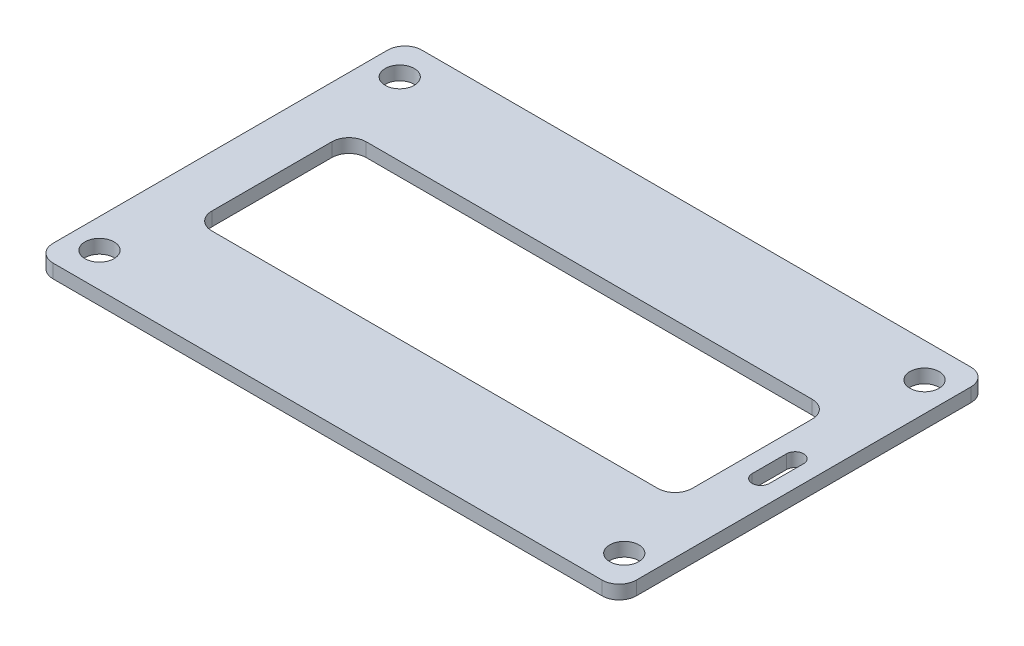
ISO-10303-21;
HEADER;
FILE_DESCRIPTION(('STEP AP214'),'2;1');
FILE_NAME('part.step','',(''),(''),'','','');
FILE_SCHEMA(('AUTOMOTIVE_DESIGN { 1 0 10303 214 1 1 1 1 }'));
ENDSEC;
DATA;
#1=APPLICATION_CONTEXT('core data for automotive mechanical design processes');
#2=APPLICATION_PROTOCOL_DEFINITION('international standard','automotive_design',2000,#1);
#3=PRODUCT_CONTEXT('',#1,'mechanical');
#4=PRODUCT('Part','Part','',(#3));
#5=PRODUCT_RELATED_PRODUCT_CATEGORY('part','',(#4));
#6=PRODUCT_DEFINITION_FORMATION('','',#4);
#7=PRODUCT_DEFINITION_CONTEXT('part definition',#1,'design');
#8=PRODUCT_DEFINITION('design','',#6,#7);
#9=PRODUCT_DEFINITION_SHAPE('','',#8);
#10=(LENGTH_UNIT() NAMED_UNIT(*) SI_UNIT(.MILLI.,.METRE.));
#11=(NAMED_UNIT(*) PLANE_ANGLE_UNIT() SI_UNIT($,.RADIAN.));
#12=(NAMED_UNIT(*) SI_UNIT($,.STERADIAN.) SOLID_ANGLE_UNIT());
#13=UNCERTAINTY_MEASURE_WITH_UNIT(LENGTH_MEASURE(1.E-05),#10,'distance_accuracy_value','');
#14=(GEOMETRIC_REPRESENTATION_CONTEXT(3) GLOBAL_UNCERTAINTY_ASSIGNED_CONTEXT((#13)) GLOBAL_UNIT_ASSIGNED_CONTEXT((#10,
#11,#12)) REPRESENTATION_CONTEXT('',''));
#15=CARTESIAN_POINT('',(0.,0.,0.));
#16=DIRECTION('',(0.,0.,1.));
#17=DIRECTION('',(1.,0.,0.));
#18=AXIS2_PLACEMENT_3D('',#15,#16,#17);
#19=CARTESIAN_POINT('',(32.,1.6,19.5));
#20=DIRECTION('',(0.,1.,0.));
#21=DIRECTION('',(0.,0.,1.));
#22=AXIS2_PLACEMENT_3D('',#19,#20,#21);
#23=PLANE('',#22);
#24=CARTESIAN_POINT('',(-30.5885113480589,1.6,17.5));
#25=DIRECTION('',(0.,1.,0.));
#26=DIRECTION('',(0.,0.,1.));
#27=AXIS2_PLACEMENT_3D('',#24,#25,#26);
#28=CIRCLE('',#27,1.69999999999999);
#29=CARTESIAN_POINT('',(-30.5885113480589,1.6,19.2));
#30=VERTEX_POINT('',#29);
#31=EDGE_CURVE('E242',#30,#30,#28,.T.);
#32=ORIENTED_EDGE('',*,*,#31,.F.);
#33=EDGE_LOOP('',(#32));
#34=FACE_BOUND('',#33,.T.);
#35=CARTESIAN_POINT('',(30.5885113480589,1.6,-17.5));
#36=DIRECTION('',(0.,1.,0.));
#37=DIRECTION('',(0.,0.,1.));
#38=AXIS2_PLACEMENT_3D('',#35,#36,#37);
#39=CIRCLE('',#38,1.69999999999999);
#40=CARTESIAN_POINT('',(30.5885113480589,1.6,-15.8));
#41=VERTEX_POINT('',#40);
#42=EDGE_CURVE('E254',#41,#41,#39,.T.);
#43=ORIENTED_EDGE('',*,*,#42,.F.);
#44=EDGE_LOOP('',(#43));
#45=FACE_BOUND('',#44,.T.);
#46=CARTESIAN_POINT('',(32.,1.6,19.5));
#47=DIRECTION('',(0.,1.,0.));
#48=DIRECTION('',(0.,0.,1.));
#49=AXIS2_PLACEMENT_3D('',#46,#47,#48);
#50=CIRCLE('',#49,2.);
#51=CARTESIAN_POINT('',(32.,1.6,21.5));
#52=VERTEX_POINT('',#51);
#53=CARTESIAN_POINT('',(34.,1.6,19.5));
#54=VERTEX_POINT('',#53);
#55=EDGE_CURVE('E291',#52,#54,#50,.T.);
#56=ORIENTED_EDGE('',*,*,#55,.T.);
#57=DIRECTION('',(0.,0.,-1.));
#58=VECTOR('',#57,1.);
#59=CARTESIAN_POINT('',(34.,1.6,19.5));
#60=LINE('',#59,#58);
#61=CARTESIAN_POINT('',(34.,1.6,-19.5));
#62=VERTEX_POINT('',#61);
#63=EDGE_CURVE('E294',#54,#62,#60,.T.);
#64=ORIENTED_EDGE('',*,*,#63,.T.);
#65=CARTESIAN_POINT('',(32.,1.6,-19.5));
#66=DIRECTION('',(0.,1.,0.));
#67=DIRECTION('',(0.,0.,1.));
#68=AXIS2_PLACEMENT_3D('',#65,#66,#67);
#69=CIRCLE('',#68,2.);
#70=CARTESIAN_POINT('',(32.,1.6,-21.5));
#71=VERTEX_POINT('',#70);
#72=EDGE_CURVE('E297',#62,#71,#69,.T.);
#73=ORIENTED_EDGE('',*,*,#72,.T.);
#74=DIRECTION('',(-1.,0.,0.));
#75=VECTOR('',#74,1.);
#76=CARTESIAN_POINT('',(32.,1.6,-21.5));
#77=LINE('',#76,#75);
#78=CARTESIAN_POINT('',(-32.,1.6,-21.5));
#79=VERTEX_POINT('',#78);
#80=EDGE_CURVE('E299',#71,#79,#77,.T.);
#81=ORIENTED_EDGE('',*,*,#80,.T.);
#82=CARTESIAN_POINT('',(-32.,1.6,-19.5));
#83=DIRECTION('',(0.,1.,0.));
#84=DIRECTION('',(0.,0.,1.));
#85=AXIS2_PLACEMENT_3D('',#82,#83,#84);
#86=CIRCLE('',#85,2.);
#87=CARTESIAN_POINT('',(-34.,1.6,-19.5));
#88=VERTEX_POINT('',#87);
#89=EDGE_CURVE('E301',#79,#88,#86,.T.);
#90=ORIENTED_EDGE('',*,*,#89,.T.);
#91=DIRECTION('',(0.,0.,1.));
#92=VECTOR('',#91,1.);
#93=CARTESIAN_POINT('',(-34.,1.6,-19.5));
#94=LINE('',#93,#92);
#95=CARTESIAN_POINT('',(-34.,1.6,19.5));
#96=VERTEX_POINT('',#95);
#97=EDGE_CURVE('E303',#88,#96,#94,.T.);
#98=ORIENTED_EDGE('',*,*,#97,.T.);
#99=CARTESIAN_POINT('',(-32.,1.6,19.5));
#100=DIRECTION('',(0.,1.,0.));
#101=DIRECTION('',(0.,0.,1.));
#102=AXIS2_PLACEMENT_3D('',#99,#100,#101);
#103=CIRCLE('',#102,2.);
#104=CARTESIAN_POINT('',(-32.,1.6,21.5));
#105=VERTEX_POINT('',#104);
#106=EDGE_CURVE('E305',#96,#105,#103,.T.);
#107=ORIENTED_EDGE('',*,*,#106,.T.);
#108=DIRECTION('',(1.,0.,0.));
#109=VECTOR('',#108,1.);
#110=CARTESIAN_POINT('',(-32.,1.6,21.5));
#111=LINE('',#110,#109);
#112=EDGE_CURVE('E307',#105,#52,#111,.T.);
#113=ORIENTED_EDGE('',*,*,#112,.T.);
#114=EDGE_LOOP('',(#56,#64,#73,#81,#90,#98,#107,#113));
#115=FACE_BOUND('',#114,.T.);
#116=DIRECTION('',(0.,0.,1.));
#117=VECTOR('',#116,1.);
#118=CARTESIAN_POINT('',(30.,1.6,-2.));
#119=LINE('',#118,#117);
#120=CARTESIAN_POINT('',(30.,1.6,-2.));
#121=VERTEX_POINT('',#120);
#122=CARTESIAN_POINT('',(30.,1.6,2.));
#123=VERTEX_POINT('',#122);
#124=EDGE_CURVE('E262',#121,#123,#119,.T.);
#125=ORIENTED_EDGE('',*,*,#124,.F.);
#126=CARTESIAN_POINT('',(31.,1.6,-2.));
#127=DIRECTION('',(0.,1.,0.));
#128=DIRECTION('',(0.,0.,1.));
#129=AXIS2_PLACEMENT_3D('',#126,#127,#128);
#130=CIRCLE('',#129,1.);
#131=CARTESIAN_POINT('',(32.,1.6,-2.));
#132=VERTEX_POINT('',#131);
#133=EDGE_CURVE('E260',#132,#121,#130,.T.);
#134=ORIENTED_EDGE('',*,*,#133,.F.);
#135=DIRECTION('',(0.,0.,-1.));
#136=VECTOR('',#135,1.);
#137=CARTESIAN_POINT('',(32.,1.6,2.));
#138=LINE('',#137,#136);
#139=CARTESIAN_POINT('',(32.,1.6,2.));
#140=VERTEX_POINT('',#139);
#141=EDGE_CURVE('E268',#140,#132,#138,.T.);
#142=ORIENTED_EDGE('',*,*,#141,.F.);
#143=CARTESIAN_POINT('',(31.,1.6,2.));
#144=DIRECTION('',(0.,1.,0.));
#145=DIRECTION('',(0.,0.,1.));
#146=AXIS2_PLACEMENT_3D('',#143,#144,#145);
#147=CIRCLE('',#146,1.);
#148=EDGE_CURVE('E265',#123,#140,#147,.T.);
#149=ORIENTED_EDGE('',*,*,#148,.F.);
#150=EDGE_LOOP('',(#125,#134,#142,#149));
#151=FACE_BOUND('',#150,.T.);
#152=CARTESIAN_POINT('',(-30.5885113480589,1.6,-17.5));
#153=DIRECTION('',(0.,1.,0.));
#154=DIRECTION('',(0.,0.,1.));
#155=AXIS2_PLACEMENT_3D('',#152,#153,#154);
#156=CIRCLE('',#155,1.69999999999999);
#157=CARTESIAN_POINT('',(-30.5885113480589,1.6,-15.8));
#158=VERTEX_POINT('',#157);
#159=EDGE_CURVE('E248',#158,#158,#156,.T.);
#160=ORIENTED_EDGE('',*,*,#159,.F.);
#161=EDGE_LOOP('',(#160));
#162=FACE_BOUND('',#161,.T.);
#163=CARTESIAN_POINT('',(30.5885113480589,1.6,17.5));
#164=DIRECTION('',(0.,1.,0.));
#165=DIRECTION('',(0.,0.,1.));
#166=AXIS2_PLACEMENT_3D('',#163,#164,#165);
#167=CIRCLE('',#166,1.69999999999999);
#168=CARTESIAN_POINT('',(30.5885113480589,1.6,19.2));
#169=VERTEX_POINT('',#168);
#170=EDGE_CURVE('E236',#169,#169,#167,.T.);
#171=ORIENTED_EDGE('',*,*,#170,.F.);
#172=EDGE_LOOP('',(#171));
#173=FACE_BOUND('',#172,.T.);
#174=DIRECTION('',(-1.,0.,0.));
#175=VECTOR('',#174,1.);
#176=CARTESIAN_POINT('',(26.,1.6,-9.));
#177=LINE('',#176,#175);
#178=CARTESIAN_POINT('',(26.,1.6,-9.));
#179=VERTEX_POINT('',#178);
#180=CARTESIAN_POINT('',(-26.,1.6,-9.));
#181=VERTEX_POINT('',#180);
#182=EDGE_CURVE('E179',#179,#181,#177,.T.);
#183=ORIENTED_EDGE('',*,*,#182,.F.);
#184=CARTESIAN_POINT('',(26.,1.6,-7.));
#185=DIRECTION('',(0.,1.,0.));
#186=DIRECTION('',(0.,0.,1.));
#187=AXIS2_PLACEMENT_3D('',#184,#185,#186);
#188=CIRCLE('',#187,2.);
#189=CARTESIAN_POINT('',(28.,1.6,-7.));
#190=VERTEX_POINT('',#189);
#191=EDGE_CURVE('E171',#190,#179,#188,.T.);
#192=ORIENTED_EDGE('',*,*,#191,.F.);
#193=DIRECTION('',(0.,0.,-1.));
#194=VECTOR('',#193,1.);
#195=CARTESIAN_POINT('',(28.,1.6,7.));
#196=LINE('',#195,#194);
#197=CARTESIAN_POINT('',(28.,1.6,7.));
#198=VERTEX_POINT('',#197);
#199=EDGE_CURVE('E204',#198,#190,#196,.T.);
#200=ORIENTED_EDGE('',*,*,#199,.F.);
#201=CARTESIAN_POINT('',(26.,1.6,7.));
#202=DIRECTION('',(0.,1.,0.));
#203=DIRECTION('',(0.,0.,1.));
#204=AXIS2_PLACEMENT_3D('',#201,#202,#203);
#205=CIRCLE('',#204,2.);
#206=CARTESIAN_POINT('',(26.,1.6,9.));
#207=VERTEX_POINT('',#206);
#208=EDGE_CURVE('E202',#207,#198,#205,.T.);
#209=ORIENTED_EDGE('',*,*,#208,.F.);
#210=DIRECTION('',(1.,0.,0.));
#211=VECTOR('',#210,1.);
#212=CARTESIAN_POINT('',(-26.,1.6,9.));
#213=LINE('',#212,#211);
#214=CARTESIAN_POINT('',(-26.,1.6,9.));
#215=VERTEX_POINT('',#214);
#216=EDGE_CURVE('E200',#215,#207,#213,.T.);
#217=ORIENTED_EDGE('',*,*,#216,.F.);
#218=CARTESIAN_POINT('',(-26.,1.6,7.));
#219=DIRECTION('',(0.,1.,0.));
#220=DIRECTION('',(0.,0.,1.));
#221=AXIS2_PLACEMENT_3D('',#218,#219,#220);
#222=CIRCLE('',#221,2.);
#223=CARTESIAN_POINT('',(-28.,1.6,7.));
#224=VERTEX_POINT('',#223);
#225=EDGE_CURVE('E198',#224,#215,#222,.T.);
#226=ORIENTED_EDGE('',*,*,#225,.F.);
#227=DIRECTION('',(0.,0.,1.));
#228=VECTOR('',#227,1.);
#229=CARTESIAN_POINT('',(-28.,1.6,-7.));
#230=LINE('',#229,#228);
#231=CARTESIAN_POINT('',(-28.,1.6,-7.));
#232=VERTEX_POINT('',#231);
#233=EDGE_CURVE('E194',#232,#224,#230,.T.);
#234=ORIENTED_EDGE('',*,*,#233,.F.);
#235=CARTESIAN_POINT('',(-26.,1.6,-7.));
#236=DIRECTION('',(0.,1.,0.));
#237=DIRECTION('',(0.,0.,1.));
#238=AXIS2_PLACEMENT_3D('',#235,#236,#237);
#239=CIRCLE('',#238,2.);
#240=EDGE_CURVE('E192',#181,#232,#239,.T.);
#241=ORIENTED_EDGE('',*,*,#240,.F.);
#242=EDGE_LOOP('',(#183,#192,#200,#209,#217,#226,#234,#241));
#243=FACE_BOUND('',#242,.T.);
#244=ADVANCED_FACE('F34',(#34,#45,#115,#151,#162,#173,#243),#23,.T.);
#245=CARTESIAN_POINT('',(32.,0.,19.5));
#246=DIRECTION('',(0.,1.,0.));
#247=DIRECTION('',(0.,0.,1.));
#248=AXIS2_PLACEMENT_3D('',#245,#246,#247);
#249=PLANE('',#248);
#250=CARTESIAN_POINT('',(30.5885113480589,0.,17.5));
#251=DIRECTION('',(0.,1.,0.));
#252=DIRECTION('',(0.,0.,1.));
#253=AXIS2_PLACEMENT_3D('',#250,#251,#252);
#254=CIRCLE('',#253,1.69999999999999);
#255=CARTESIAN_POINT('',(30.5885113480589,0.,19.2));
#256=VERTEX_POINT('',#255);
#257=EDGE_CURVE('E187',#256,#256,#254,.T.);
#258=ORIENTED_EDGE('',*,*,#257,.T.);
#259=EDGE_LOOP('',(#258));
#260=FACE_BOUND('',#259,.T.);
#261=CARTESIAN_POINT('',(-30.5885113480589,0.,17.5));
#262=DIRECTION('',(0.,1.,0.));
#263=DIRECTION('',(0.,0.,1.));
#264=AXIS2_PLACEMENT_3D('',#261,#262,#263);
#265=CIRCLE('',#264,1.69999999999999);
#266=CARTESIAN_POINT('',(-30.5885113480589,0.,19.2));
#267=VERTEX_POINT('',#266);
#268=EDGE_CURVE('E239',#267,#267,#265,.T.);
#269=ORIENTED_EDGE('',*,*,#268,.T.);
#270=EDGE_LOOP('',(#269));
#271=FACE_BOUND('',#270,.T.);
#272=CARTESIAN_POINT('',(-30.5885113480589,0.,-17.5));
#273=DIRECTION('',(0.,1.,0.));
#274=DIRECTION('',(0.,0.,1.));
#275=AXIS2_PLACEMENT_3D('',#272,#273,#274);
#276=CIRCLE('',#275,1.69999999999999);
#277=CARTESIAN_POINT('',(-30.5885113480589,0.,-15.8));
#278=VERTEX_POINT('',#277);
#279=EDGE_CURVE('E245',#278,#278,#276,.T.);
#280=ORIENTED_EDGE('',*,*,#279,.T.);
#281=EDGE_LOOP('',(#280));
#282=FACE_BOUND('',#281,.T.);
#283=CARTESIAN_POINT('',(30.5885113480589,0.,-17.5));
#284=DIRECTION('',(0.,1.,0.));
#285=DIRECTION('',(0.,0.,1.));
#286=AXIS2_PLACEMENT_3D('',#283,#284,#285);
#287=CIRCLE('',#286,1.69999999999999);
#288=CARTESIAN_POINT('',(30.5885113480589,0.,-15.8));
#289=VERTEX_POINT('',#288);
#290=EDGE_CURVE('E251',#289,#289,#287,.T.);
#291=ORIENTED_EDGE('',*,*,#290,.T.);
#292=EDGE_LOOP('',(#291));
#293=FACE_BOUND('',#292,.T.);
#294=CARTESIAN_POINT('',(31.,0.,-2.));
#295=DIRECTION('',(0.,1.,0.));
#296=DIRECTION('',(0.,0.,1.));
#297=AXIS2_PLACEMENT_3D('',#294,#295,#296);
#298=CIRCLE('',#297,1.);
#299=CARTESIAN_POINT('',(32.,0.,-2.));
#300=VERTEX_POINT('',#299);
#301=CARTESIAN_POINT('',(30.,0.,-2.));
#302=VERTEX_POINT('',#301);
#303=EDGE_CURVE('E257',#300,#302,#298,.T.);
#304=ORIENTED_EDGE('',*,*,#303,.T.);
#305=DIRECTION('',(0.,0.,1.));
#306=VECTOR('',#305,1.);
#307=CARTESIAN_POINT('',(30.,0.,-2.));
#308=LINE('',#307,#306);
#309=CARTESIAN_POINT('',(30.,0.,2.));
#310=VERTEX_POINT('',#309);
#311=EDGE_CURVE('E273',#302,#310,#308,.T.);
#312=ORIENTED_EDGE('',*,*,#311,.T.);
#313=CARTESIAN_POINT('',(31.,0.,2.));
#314=DIRECTION('',(0.,1.,0.));
#315=DIRECTION('',(0.,0.,1.));
#316=AXIS2_PLACEMENT_3D('',#313,#314,#315);
#317=CIRCLE('',#316,1.);
#318=CARTESIAN_POINT('',(32.,0.,2.));
#319=VERTEX_POINT('',#318);
#320=EDGE_CURVE('E276',#310,#319,#317,.T.);
#321=ORIENTED_EDGE('',*,*,#320,.T.);
#322=DIRECTION('',(0.,0.,-1.));
#323=VECTOR('',#322,1.);
#324=CARTESIAN_POINT('',(32.,0.,2.));
#325=LINE('',#324,#323);
#326=EDGE_CURVE('E263',#319,#300,#325,.T.);
#327=ORIENTED_EDGE('',*,*,#326,.T.);
#328=EDGE_LOOP('',(#304,#312,#321,#327));
#329=FACE_BOUND('',#328,.T.);
#330=CARTESIAN_POINT('',(32.,0.,19.5));
#331=DIRECTION('',(0.,1.,0.));
#332=DIRECTION('',(0.,0.,1.));
#333=AXIS2_PLACEMENT_3D('',#330,#331,#332);
#334=CIRCLE('',#333,2.);
#335=CARTESIAN_POINT('',(32.,0.,21.5));
#336=VERTEX_POINT('',#335);
#337=CARTESIAN_POINT('',(34.,0.,19.5));
#338=VERTEX_POINT('',#337);
#339=EDGE_CURVE('E290',#336,#338,#334,.T.);
#340=ORIENTED_EDGE('',*,*,#339,.F.);
#341=DIRECTION('',(1.,0.,0.));
#342=VECTOR('',#341,1.);
#343=CARTESIAN_POINT('',(-32.,0.,21.5));
#344=LINE('',#343,#342);
#345=CARTESIAN_POINT('',(-32.,0.,21.5));
#346=VERTEX_POINT('',#345);
#347=EDGE_CURVE('E295',#346,#336,#344,.T.);
#348=ORIENTED_EDGE('',*,*,#347,.F.);
#349=CARTESIAN_POINT('',(-32.,0.,19.5));
#350=DIRECTION('',(0.,1.,0.));
#351=DIRECTION('',(0.,0.,1.));
#352=AXIS2_PLACEMENT_3D('',#349,#350,#351);
#353=CIRCLE('',#352,2.);
#354=CARTESIAN_POINT('',(-34.,0.,19.5));
#355=VERTEX_POINT('',#354);
#356=EDGE_CURVE('E322',#355,#346,#353,.T.);
#357=ORIENTED_EDGE('',*,*,#356,.F.);
#358=DIRECTION('',(0.,0.,1.));
#359=VECTOR('',#358,1.);
#360=CARTESIAN_POINT('',(-34.,0.,-19.5));
#361=LINE('',#360,#359);
#362=CARTESIAN_POINT('',(-34.,0.,-19.5));
#363=VERTEX_POINT('',#362);
#364=EDGE_CURVE('E320',#363,#355,#361,.T.);
#365=ORIENTED_EDGE('',*,*,#364,.F.);
#366=CARTESIAN_POINT('',(-32.,0.,-19.5));
#367=DIRECTION('',(0.,1.,0.));
#368=DIRECTION('',(0.,0.,1.));
#369=AXIS2_PLACEMENT_3D('',#366,#367,#368);
#370=CIRCLE('',#369,2.);
#371=CARTESIAN_POINT('',(-32.,0.,-21.5));
#372=VERTEX_POINT('',#371);
#373=EDGE_CURVE('E318',#372,#363,#370,.T.);
#374=ORIENTED_EDGE('',*,*,#373,.F.);
#375=DIRECTION('',(-1.,0.,0.));
#376=VECTOR('',#375,1.);
#377=CARTESIAN_POINT('',(32.,0.,-21.5));
#378=LINE('',#377,#376);
#379=CARTESIAN_POINT('',(32.,0.,-21.5));
#380=VERTEX_POINT('',#379);
#381=EDGE_CURVE('E316',#380,#372,#378,.T.);
#382=ORIENTED_EDGE('',*,*,#381,.F.);
#383=CARTESIAN_POINT('',(32.,0.,-19.5));
#384=DIRECTION('',(0.,1.,0.));
#385=DIRECTION('',(0.,0.,1.));
#386=AXIS2_PLACEMENT_3D('',#383,#384,#385);
#387=CIRCLE('',#386,2.);
#388=CARTESIAN_POINT('',(34.,0.,-19.5));
#389=VERTEX_POINT('',#388);
#390=EDGE_CURVE('E314',#389,#380,#387,.T.);
#391=ORIENTED_EDGE('',*,*,#390,.F.);
#392=DIRECTION('',(0.,0.,-1.));
#393=VECTOR('',#392,1.);
#394=CARTESIAN_POINT('',(34.,0.,19.5));
#395=LINE('',#394,#393);
#396=EDGE_CURVE('E312',#338,#389,#395,.T.);
#397=ORIENTED_EDGE('',*,*,#396,.F.);
#398=EDGE_LOOP('',(#340,#348,#357,#365,#374,#382,#391,#397));
#399=FACE_BOUND('',#398,.T.);
#400=CARTESIAN_POINT('',(26.,0.,-7.));
#401=DIRECTION('',(0.,1.,0.));
#402=DIRECTION('',(0.,0.,1.));
#403=AXIS2_PLACEMENT_3D('',#400,#401,#402);
#404=CIRCLE('',#403,2.);
#405=CARTESIAN_POINT('',(28.,0.,-7.));
#406=VERTEX_POINT('',#405);
#407=CARTESIAN_POINT('',(26.,0.,-9.));
#408=VERTEX_POINT('',#407);
#409=EDGE_CURVE('E57',#406,#408,#404,.T.);
#410=ORIENTED_EDGE('',*,*,#409,.T.);
#411=DIRECTION('',(-1.,0.,0.));
#412=VECTOR('',#411,1.);
#413=CARTESIAN_POINT('',(26.,0.,-9.));
#414=LINE('',#413,#412);
#415=CARTESIAN_POINT('',(-26.,0.,-9.));
#416=VERTEX_POINT('',#415);
#417=EDGE_CURVE('E186',#408,#416,#414,.T.);
#418=ORIENTED_EDGE('',*,*,#417,.T.);
#419=CARTESIAN_POINT('',(-26.,0.,-7.));
#420=DIRECTION('',(0.,1.,0.));
#421=DIRECTION('',(0.,0.,1.));
#422=AXIS2_PLACEMENT_3D('',#419,#420,#421);
#423=CIRCLE('',#422,2.);
#424=CARTESIAN_POINT('',(-28.,0.,-7.));
#425=VERTEX_POINT('',#424);
#426=EDGE_CURVE('E208',#416,#425,#423,.T.);
#427=ORIENTED_EDGE('',*,*,#426,.T.);
#428=DIRECTION('',(0.,0.,1.));
#429=VECTOR('',#428,1.);
#430=CARTESIAN_POINT('',(-28.,0.,-7.));
#431=LINE('',#430,#429);
#432=CARTESIAN_POINT('',(-28.,0.,7.));
#433=VERTEX_POINT('',#432);
#434=EDGE_CURVE('E211',#425,#433,#431,.T.);
#435=ORIENTED_EDGE('',*,*,#434,.T.);
#436=CARTESIAN_POINT('',(-26.,0.,7.));
#437=DIRECTION('',(0.,1.,0.));
#438=DIRECTION('',(0.,0.,1.));
#439=AXIS2_PLACEMENT_3D('',#436,#437,#438);
#440=CIRCLE('',#439,2.);
#441=CARTESIAN_POINT('',(-26.,0.,9.));
#442=VERTEX_POINT('',#441);
#443=EDGE_CURVE('E214',#433,#442,#440,.T.);
#444=ORIENTED_EDGE('',*,*,#443,.T.);
#445=DIRECTION('',(1.,0.,0.));
#446=VECTOR('',#445,1.);
#447=CARTESIAN_POINT('',(-26.,0.,9.));
#448=LINE('',#447,#446);
#449=CARTESIAN_POINT('',(26.,0.,9.));
#450=VERTEX_POINT('',#449);
#451=EDGE_CURVE('E217',#442,#450,#448,.T.);
#452=ORIENTED_EDGE('',*,*,#451,.T.);
#453=CARTESIAN_POINT('',(26.,0.,7.));
#454=DIRECTION('',(0.,1.,0.));
#455=DIRECTION('',(0.,0.,1.));
#456=AXIS2_PLACEMENT_3D('',#453,#454,#455);
#457=CIRCLE('',#456,2.);
#458=CARTESIAN_POINT('',(28.,0.,7.));
#459=VERTEX_POINT('',#458);
#460=EDGE_CURVE('E220',#450,#459,#457,.T.);
#461=ORIENTED_EDGE('',*,*,#460,.T.);
#462=DIRECTION('',(0.,0.,-1.));
#463=VECTOR('',#462,1.);
#464=CARTESIAN_POINT('',(28.,0.,7.));
#465=LINE('',#464,#463);
#466=EDGE_CURVE('E180',#459,#406,#465,.T.);
#467=ORIENTED_EDGE('',*,*,#466,.T.);
#468=EDGE_LOOP('',(#410,#418,#427,#435,#444,#452,#461,#467));
#469=FACE_BOUND('',#468,.T.);
#470=ADVANCED_FACE('F352',(#260,#271,#282,#293,#329,#399,#469),#249,.F.);
#471=CARTESIAN_POINT('',(32.,1.6,19.5));
#472=DIRECTION('',(0.,-1.,0.));
#473=DIRECTION('',(0.,0.,-1.));
#474=AXIS2_PLACEMENT_3D('',#471,#472,#473);
#475=CYLINDRICAL_SURFACE('',#474,2.);
#476=ORIENTED_EDGE('',*,*,#339,.T.);
#477=DIRECTION('',(0.,-1.,0.));
#478=VECTOR('',#477,1.);
#479=CARTESIAN_POINT('',(34.,1.6,19.5));
#480=LINE('',#479,#478);
#481=EDGE_CURVE('E11',#54,#338,#480,.T.);
#482=ORIENTED_EDGE('',*,*,#481,.F.);
#483=ORIENTED_EDGE('',*,*,#55,.F.);
#484=DIRECTION('',(0.,-1.,0.));
#485=VECTOR('',#484,1.);
#486=CARTESIAN_POINT('',(32.,1.6,21.5));
#487=LINE('',#486,#485);
#488=EDGE_CURVE('E309',#52,#336,#487,.T.);
#489=ORIENTED_EDGE('',*,*,#488,.T.);
#490=EDGE_LOOP('',(#476,#482,#483,#489));
#491=FACE_BOUND('',#490,.T.);
#492=ADVANCED_FACE('F36',(#491),#475,.T.);
#493=CARTESIAN_POINT('',(34.,1.6,19.5));
#494=DIRECTION('',(-1.,0.,0.));
#495=DIRECTION('',(0.,0.,1.));
#496=AXIS2_PLACEMENT_3D('',#493,#494,#495);
#497=PLANE('',#496);
#498=ORIENTED_EDGE('',*,*,#396,.T.);
#499=DIRECTION('',(0.,-1.,0.));
#500=VECTOR('',#499,1.);
#501=CARTESIAN_POINT('',(34.,1.6,-19.5));
#502=LINE('',#501,#500);
#503=EDGE_CURVE('E42',#62,#389,#502,.T.);
#504=ORIENTED_EDGE('',*,*,#503,.F.);
#505=ORIENTED_EDGE('',*,*,#63,.F.);
#506=ORIENTED_EDGE('',*,*,#481,.T.);
#507=EDGE_LOOP('',(#498,#504,#505,#506));
#508=FACE_BOUND('',#507,.T.);
#509=ADVANCED_FACE('F370',(#508),#497,.F.);
#510=CARTESIAN_POINT('',(32.,1.6,-19.5));
#511=DIRECTION('',(0.,-1.,0.));
#512=DIRECTION('',(0.,0.,-1.));
#513=AXIS2_PLACEMENT_3D('',#510,#511,#512);
#514=CYLINDRICAL_SURFACE('',#513,2.);
#515=ORIENTED_EDGE('',*,*,#390,.T.);
#516=DIRECTION('',(0.,-1.,0.));
#517=VECTOR('',#516,1.);
#518=CARTESIAN_POINT('',(32.,1.6,-21.5));
#519=LINE('',#518,#517);
#520=EDGE_CURVE('E339',#71,#380,#519,.T.);
#521=ORIENTED_EDGE('',*,*,#520,.F.);
#522=ORIENTED_EDGE('',*,*,#72,.F.);
#523=ORIENTED_EDGE('',*,*,#503,.T.);
#524=EDGE_LOOP('',(#515,#521,#522,#523));
#525=FACE_BOUND('',#524,.T.);
#526=ADVANCED_FACE('F346',(#525),#514,.T.);
#527=CARTESIAN_POINT('',(32.,1.6,-21.5));
#528=DIRECTION('',(0.,0.,1.));
#529=DIRECTION('',(1.,0.,0.));
#530=AXIS2_PLACEMENT_3D('',#527,#528,#529);
#531=PLANE('',#530);
#532=ORIENTED_EDGE('',*,*,#381,.T.);
#533=DIRECTION('',(0.,-1.,0.));
#534=VECTOR('',#533,1.);
#535=CARTESIAN_POINT('',(-32.,1.6,-21.5));
#536=LINE('',#535,#534);
#537=EDGE_CURVE('E336',#79,#372,#536,.T.);
#538=ORIENTED_EDGE('',*,*,#537,.F.);
#539=ORIENTED_EDGE('',*,*,#80,.F.);
#540=ORIENTED_EDGE('',*,*,#520,.T.);
#541=EDGE_LOOP('',(#532,#538,#539,#540));
#542=FACE_BOUND('',#541,.T.);
#543=ADVANCED_FACE('F358',(#542),#531,.F.);
#544=CARTESIAN_POINT('',(-32.,1.6,-19.5));
#545=DIRECTION('',(0.,-1.,0.));
#546=DIRECTION('',(0.,0.,-1.));
#547=AXIS2_PLACEMENT_3D('',#544,#545,#546);
#548=CYLINDRICAL_SURFACE('',#547,2.);
#549=ORIENTED_EDGE('',*,*,#373,.T.);
#550=DIRECTION('',(0.,-1.,0.));
#551=VECTOR('',#550,1.);
#552=CARTESIAN_POINT('',(-34.,1.6,-19.5));
#553=LINE('',#552,#551);
#554=EDGE_CURVE('E333',#88,#363,#553,.T.);
#555=ORIENTED_EDGE('',*,*,#554,.F.);
#556=ORIENTED_EDGE('',*,*,#89,.F.);
#557=ORIENTED_EDGE('',*,*,#537,.T.);
#558=EDGE_LOOP('',(#549,#555,#556,#557));
#559=FACE_BOUND('',#558,.T.);
#560=ADVANCED_FACE('F362',(#559),#548,.T.);
#561=CARTESIAN_POINT('',(-34.,1.6,-19.5));
#562=DIRECTION('',(1.,0.,0.));
#563=DIRECTION('',(0.,0.,-1.));
#564=AXIS2_PLACEMENT_3D('',#561,#562,#563);
#565=PLANE('',#564);
#566=ORIENTED_EDGE('',*,*,#364,.T.);
#567=DIRECTION('',(0.,-1.,0.));
#568=VECTOR('',#567,1.);
#569=CARTESIAN_POINT('',(-34.,1.6,19.5));
#570=LINE('',#569,#568);
#571=EDGE_CURVE('E330',#96,#355,#570,.T.);
#572=ORIENTED_EDGE('',*,*,#571,.F.);
#573=ORIENTED_EDGE('',*,*,#97,.F.);
#574=ORIENTED_EDGE('',*,*,#554,.T.);
#575=EDGE_LOOP('',(#566,#572,#573,#574));
#576=FACE_BOUND('',#575,.T.);
#577=ADVANCED_FACE('F383',(#576),#565,.F.);
#578=CARTESIAN_POINT('',(-32.,1.6,19.5));
#579=DIRECTION('',(0.,-1.,0.));
#580=DIRECTION('',(0.,0.,-1.));
#581=AXIS2_PLACEMENT_3D('',#578,#579,#580);
#582=CYLINDRICAL_SURFACE('',#581,2.);
#583=ORIENTED_EDGE('',*,*,#356,.T.);
#584=DIRECTION('',(0.,-1.,0.));
#585=VECTOR('',#584,1.);
#586=CARTESIAN_POINT('',(-32.,1.6,21.5));
#587=LINE('',#586,#585);
#588=EDGE_CURVE('E327',#105,#346,#587,.T.);
#589=ORIENTED_EDGE('',*,*,#588,.F.);
#590=ORIENTED_EDGE('',*,*,#106,.F.);
#591=ORIENTED_EDGE('',*,*,#571,.T.);
#592=EDGE_LOOP('',(#583,#589,#590,#591));
#593=FACE_BOUND('',#592,.T.);
#594=ADVANCED_FACE('F381',(#593),#582,.T.);
#595=CARTESIAN_POINT('',(-32.,1.6,21.5));
#596=DIRECTION('',(0.,0.,-1.));
#597=DIRECTION('',(-1.,0.,0.));
#598=AXIS2_PLACEMENT_3D('',#595,#596,#597);
#599=PLANE('',#598);
#600=ORIENTED_EDGE('',*,*,#347,.T.);
#601=ORIENTED_EDGE('',*,*,#488,.F.);
#602=ORIENTED_EDGE('',*,*,#112,.F.);
#603=ORIENTED_EDGE('',*,*,#588,.T.);
#604=EDGE_LOOP('',(#600,#601,#602,#603));
#605=FACE_BOUND('',#604,.T.);
#606=ADVANCED_FACE('F376',(#605),#599,.F.);
#607=CARTESIAN_POINT('',(31.,1.6,-2.));
#608=DIRECTION('',(0.,-1.,0.));
#609=DIRECTION('',(0.,0.,-1.));
#610=AXIS2_PLACEMENT_3D('',#607,#608,#609);
#611=CYLINDRICAL_SURFACE('',#610,1.);
#612=ORIENTED_EDGE('',*,*,#303,.F.);
#613=DIRECTION('',(0.,-1.,0.));
#614=VECTOR('',#613,1.);
#615=CARTESIAN_POINT('',(32.,1.6,-2.));
#616=LINE('',#615,#614);
#617=EDGE_CURVE('E270',#132,#300,#616,.T.);
#618=ORIENTED_EDGE('',*,*,#617,.F.);
#619=ORIENTED_EDGE('',*,*,#133,.T.);
#620=DIRECTION('',(0.,-1.,0.));
#621=VECTOR('',#620,1.);
#622=CARTESIAN_POINT('',(30.,1.6,-2.));
#623=LINE('',#622,#621);
#624=EDGE_CURVE('E287',#121,#302,#623,.T.);
#625=ORIENTED_EDGE('',*,*,#624,.T.);
#626=EDGE_LOOP('',(#612,#618,#619,#625));
#627=FACE_BOUND('',#626,.T.);
#628=ADVANCED_FACE('F403',(#627),#611,.F.);
#629=CARTESIAN_POINT('',(30.,1.6,-2.));
#630=DIRECTION('',(1.,0.,0.));
#631=DIRECTION('',(0.,0.,-1.));
#632=AXIS2_PLACEMENT_3D('',#629,#630,#631);
#633=PLANE('',#632);
#634=ORIENTED_EDGE('',*,*,#311,.F.);
#635=ORIENTED_EDGE('',*,*,#624,.F.);
#636=ORIENTED_EDGE('',*,*,#124,.T.);
#637=DIRECTION('',(0.,-1.,0.));
#638=VECTOR('',#637,1.);
#639=CARTESIAN_POINT('',(30.,1.6,2.));
#640=LINE('',#639,#638);
#641=EDGE_CURVE('E285',#123,#310,#640,.T.);
#642=ORIENTED_EDGE('',*,*,#641,.T.);
#643=EDGE_LOOP('',(#634,#635,#636,#642));
#644=FACE_BOUND('',#643,.T.);
#645=ADVANCED_FACE('F410',(#644),#633,.T.);
#646=CARTESIAN_POINT('',(31.,1.6,2.));
#647=DIRECTION('',(0.,-1.,0.));
#648=DIRECTION('',(0.,0.,-1.));
#649=AXIS2_PLACEMENT_3D('',#646,#647,#648);
#650=CYLINDRICAL_SURFACE('',#649,1.);
#651=ORIENTED_EDGE('',*,*,#320,.F.);
#652=ORIENTED_EDGE('',*,*,#641,.F.);
#653=ORIENTED_EDGE('',*,*,#148,.T.);
#654=DIRECTION('',(0.,-1.,0.));
#655=VECTOR('',#654,1.);
#656=CARTESIAN_POINT('',(32.,1.6,2.));
#657=LINE('',#656,#655);
#658=EDGE_CURVE('E283',#140,#319,#657,.T.);
#659=ORIENTED_EDGE('',*,*,#658,.T.);
#660=EDGE_LOOP('',(#651,#652,#653,#659));
#661=FACE_BOUND('',#660,.T.);
#662=ADVANCED_FACE('F415',(#661),#650,.F.);
#663=CARTESIAN_POINT('',(32.,1.6,2.));
#664=DIRECTION('',(-1.,0.,0.));
#665=DIRECTION('',(0.,0.,1.));
#666=AXIS2_PLACEMENT_3D('',#663,#664,#665);
#667=PLANE('',#666);
#668=ORIENTED_EDGE('',*,*,#326,.F.);
#669=ORIENTED_EDGE('',*,*,#658,.F.);
#670=ORIENTED_EDGE('',*,*,#141,.T.);
#671=ORIENTED_EDGE('',*,*,#617,.T.);
#672=EDGE_LOOP('',(#668,#669,#670,#671));
#673=FACE_BOUND('',#672,.T.);
#674=ADVANCED_FACE('F423',(#673),#667,.T.);
#675=CARTESIAN_POINT('',(30.5885113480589,1.6,-17.5));
#676=DIRECTION('',(0.,-1.,0.));
#677=DIRECTION('',(0.,0.,-1.));
#678=AXIS2_PLACEMENT_3D('',#675,#676,#677);
#679=CYLINDRICAL_SURFACE('',#678,1.69999999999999);
#680=ORIENTED_EDGE('',*,*,#42,.T.);
#681=EDGE_LOOP('',(#680));
#682=FACE_BOUND('',#681,.T.);
#683=ORIENTED_EDGE('',*,*,#290,.F.);
#684=EDGE_LOOP('',(#683));
#685=FACE_BOUND('',#684,.T.);
#686=ADVANCED_FACE('F448',(#682,#685),#679,.F.);
#687=CARTESIAN_POINT('',(-30.5885113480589,1.6,-17.5));
#688=DIRECTION('',(0.,-1.,0.));
#689=DIRECTION('',(0.,0.,-1.));
#690=AXIS2_PLACEMENT_3D('',#687,#688,#689);
#691=CYLINDRICAL_SURFACE('',#690,1.69999999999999);
#692=ORIENTED_EDGE('',*,*,#159,.T.);
#693=EDGE_LOOP('',(#692));
#694=FACE_BOUND('',#693,.T.);
#695=ORIENTED_EDGE('',*,*,#279,.F.);
#696=EDGE_LOOP('',(#695));
#697=FACE_BOUND('',#696,.T.);
#698=ADVANCED_FACE('F450',(#694,#697),#691,.F.);
#699=CARTESIAN_POINT('',(-30.5885113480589,1.6,17.5));
#700=DIRECTION('',(0.,-1.,0.));
#701=DIRECTION('',(0.,0.,-1.));
#702=AXIS2_PLACEMENT_3D('',#699,#700,#701);
#703=CYLINDRICAL_SURFACE('',#702,1.69999999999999);
#704=ORIENTED_EDGE('',*,*,#31,.T.);
#705=EDGE_LOOP('',(#704));
#706=FACE_BOUND('',#705,.T.);
#707=ORIENTED_EDGE('',*,*,#268,.F.);
#708=EDGE_LOOP('',(#707));
#709=FACE_BOUND('',#708,.T.);
#710=ADVANCED_FACE('F438',(#706,#709),#703,.F.);
#711=CARTESIAN_POINT('',(30.5885113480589,1.6,17.5));
#712=DIRECTION('',(0.,-1.,0.));
#713=DIRECTION('',(0.,0.,-1.));
#714=AXIS2_PLACEMENT_3D('',#711,#712,#713);
#715=CYLINDRICAL_SURFACE('',#714,1.69999999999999);
#716=ORIENTED_EDGE('',*,*,#170,.T.);
#717=EDGE_LOOP('',(#716));
#718=FACE_BOUND('',#717,.T.);
#719=ORIENTED_EDGE('',*,*,#257,.F.);
#720=EDGE_LOOP('',(#719));
#721=FACE_BOUND('',#720,.T.);
#722=ADVANCED_FACE('F435',(#718,#721),#715,.F.);
#723=CARTESIAN_POINT('',(26.,1.6,-7.));
#724=DIRECTION('',(0.,-1.,0.));
#725=DIRECTION('',(0.,0.,-1.));
#726=AXIS2_PLACEMENT_3D('',#723,#724,#725);
#727=CYLINDRICAL_SURFACE('',#726,2.);
#728=ORIENTED_EDGE('',*,*,#409,.F.);
#729=DIRECTION('',(0.,-1.,0.));
#730=VECTOR('',#729,1.);
#731=CARTESIAN_POINT('',(28.,1.6,-7.));
#732=LINE('',#731,#730);
#733=EDGE_CURVE('E175',#190,#406,#732,.T.);
#734=ORIENTED_EDGE('',*,*,#733,.F.);
#735=ORIENTED_EDGE('',*,*,#191,.T.);
#736=DIRECTION('',(0.,-1.,0.));
#737=VECTOR('',#736,1.);
#738=CARTESIAN_POINT('',(26.,1.6,-9.));
#739=LINE('',#738,#737);
#740=EDGE_CURVE('E174',#179,#408,#739,.T.);
#741=ORIENTED_EDGE('',*,*,#740,.T.);
#742=EDGE_LOOP('',(#728,#734,#735,#741));
#743=FACE_BOUND('',#742,.T.);
#744=ADVANCED_FACE('F173',(#743),#727,.F.);
#745=CARTESIAN_POINT('',(26.,1.6,-9.));
#746=DIRECTION('',(0.,0.,1.));
#747=DIRECTION('',(1.,0.,0.));
#748=AXIS2_PLACEMENT_3D('',#745,#746,#747);
#749=PLANE('',#748);
#750=ORIENTED_EDGE('',*,*,#417,.F.);
#751=ORIENTED_EDGE('',*,*,#740,.F.);
#752=ORIENTED_EDGE('',*,*,#182,.T.);
#753=DIRECTION('',(0.,-1.,0.));
#754=VECTOR('',#753,1.);
#755=CARTESIAN_POINT('',(-26.,1.6,-9.));
#756=LINE('',#755,#754);
#757=EDGE_CURVE('E188',#181,#416,#756,.T.);
#758=ORIENTED_EDGE('',*,*,#757,.T.);
#759=EDGE_LOOP('',(#750,#751,#752,#758));
#760=FACE_BOUND('',#759,.T.);
#761=ADVANCED_FACE('F183',(#760),#749,.T.);
#762=CARTESIAN_POINT('',(-26.,1.6,-7.));
#763=DIRECTION('',(0.,-1.,0.));
#764=DIRECTION('',(0.,0.,-1.));
#765=AXIS2_PLACEMENT_3D('',#762,#763,#764);
#766=CYLINDRICAL_SURFACE('',#765,2.);
#767=ORIENTED_EDGE('',*,*,#426,.F.);
#768=ORIENTED_EDGE('',*,*,#757,.F.);
#769=ORIENTED_EDGE('',*,*,#240,.T.);
#770=DIRECTION('',(0.,-1.,0.));
#771=VECTOR('',#770,1.);
#772=CARTESIAN_POINT('',(-28.,1.6,-7.));
#773=LINE('',#772,#771);
#774=EDGE_CURVE('E233',#232,#425,#773,.T.);
#775=ORIENTED_EDGE('',*,*,#774,.T.);
#776=EDGE_LOOP('',(#767,#768,#769,#775));
#777=FACE_BOUND('',#776,.T.);
#778=ADVANCED_FACE('F512',(#777),#766,.F.);
#779=CARTESIAN_POINT('',(-28.,1.6,-7.));
#780=DIRECTION('',(1.,0.,0.));
#781=DIRECTION('',(0.,0.,-1.));
#782=AXIS2_PLACEMENT_3D('',#779,#780,#781);
#783=PLANE('',#782);
#784=ORIENTED_EDGE('',*,*,#434,.F.);
#785=ORIENTED_EDGE('',*,*,#774,.F.);
#786=ORIENTED_EDGE('',*,*,#233,.T.);
#787=DIRECTION('',(0.,-1.,0.));
#788=VECTOR('',#787,1.);
#789=CARTESIAN_POINT('',(-28.,1.6,7.));
#790=LINE('',#789,#788);
#791=EDGE_CURVE('E231',#224,#433,#790,.T.);
#792=ORIENTED_EDGE('',*,*,#791,.T.);
#793=EDGE_LOOP('',(#784,#785,#786,#792));
#794=FACE_BOUND('',#793,.T.);
#795=ADVANCED_FACE('F521',(#794),#783,.T.);
#796=CARTESIAN_POINT('',(-26.,1.6,7.));
#797=DIRECTION('',(0.,-1.,0.));
#798=DIRECTION('',(0.,0.,-1.));
#799=AXIS2_PLACEMENT_3D('',#796,#797,#798);
#800=CYLINDRICAL_SURFACE('',#799,2.);
#801=ORIENTED_EDGE('',*,*,#443,.F.);
#802=ORIENTED_EDGE('',*,*,#791,.F.);
#803=ORIENTED_EDGE('',*,*,#225,.T.);
#804=DIRECTION('',(0.,-1.,0.));
#805=VECTOR('',#804,1.);
#806=CARTESIAN_POINT('',(-26.,1.6,9.));
#807=LINE('',#806,#805);
#808=EDGE_CURVE('E229',#215,#442,#807,.T.);
#809=ORIENTED_EDGE('',*,*,#808,.T.);
#810=EDGE_LOOP('',(#801,#802,#803,#809));
#811=FACE_BOUND('',#810,.T.);
#812=ADVANCED_FACE('F531',(#811),#800,.F.);
#813=CARTESIAN_POINT('',(-26.,1.6,9.));
#814=DIRECTION('',(0.,0.,-1.));
#815=DIRECTION('',(-1.,0.,0.));
#816=AXIS2_PLACEMENT_3D('',#813,#814,#815);
#817=PLANE('',#816);
#818=ORIENTED_EDGE('',*,*,#451,.F.);
#819=ORIENTED_EDGE('',*,*,#808,.F.);
#820=ORIENTED_EDGE('',*,*,#216,.T.);
#821=DIRECTION('',(0.,-1.,0.));
#822=VECTOR('',#821,1.);
#823=CARTESIAN_POINT('',(26.,1.6,9.));
#824=LINE('',#823,#822);
#825=EDGE_CURVE('E227',#207,#450,#824,.T.);
#826=ORIENTED_EDGE('',*,*,#825,.T.);
#827=EDGE_LOOP('',(#818,#819,#820,#826));
#828=FACE_BOUND('',#827,.T.);
#829=ADVANCED_FACE('F541',(#828),#817,.T.);
#830=CARTESIAN_POINT('',(26.,1.6,7.));
#831=DIRECTION('',(0.,-1.,0.));
#832=DIRECTION('',(0.,0.,-1.));
#833=AXIS2_PLACEMENT_3D('',#830,#831,#832);
#834=CYLINDRICAL_SURFACE('',#833,2.);
#835=ORIENTED_EDGE('',*,*,#460,.F.);
#836=ORIENTED_EDGE('',*,*,#825,.F.);
#837=ORIENTED_EDGE('',*,*,#208,.T.);
#838=DIRECTION('',(0.,-1.,0.));
#839=VECTOR('',#838,1.);
#840=CARTESIAN_POINT('',(28.,1.6,7.));
#841=LINE('',#840,#839);
#842=EDGE_CURVE('E49',#198,#459,#841,.T.);
#843=ORIENTED_EDGE('',*,*,#842,.T.);
#844=EDGE_LOOP('',(#835,#836,#837,#843));
#845=FACE_BOUND('',#844,.T.);
#846=ADVANCED_FACE('F551',(#845),#834,.F.);
#847=CARTESIAN_POINT('',(28.,1.6,7.));
#848=DIRECTION('',(-1.,0.,0.));
#849=DIRECTION('',(0.,0.,1.));
#850=AXIS2_PLACEMENT_3D('',#847,#848,#849);
#851=PLANE('',#850);
#852=ORIENTED_EDGE('',*,*,#466,.F.);
#853=ORIENTED_EDGE('',*,*,#842,.F.);
#854=ORIENTED_EDGE('',*,*,#199,.T.);
#855=ORIENTED_EDGE('',*,*,#733,.T.);
#856=EDGE_LOOP('',(#852,#853,#854,#855));
#857=FACE_BOUND('',#856,.T.);
#858=ADVANCED_FACE('F561',(#857),#851,.T.);
#859=CLOSED_SHELL('',(#244,#470,#492,#509,#526,#543,#560,#577,#594,#606,#628,#645,#662,#674,
#686,#698,#710,#722,#744,#761,#778,#795,#812,#829,#846,#858));
#860=MANIFOLD_SOLID_BREP('B2',#859);
#861=ADVANCED_BREP_SHAPE_REPRESENTATION('',(#18,#860),#14);
#862=SHAPE_DEFINITION_REPRESENTATION(#9,#861);
ENDSEC;
END-ISO-10303-21;
